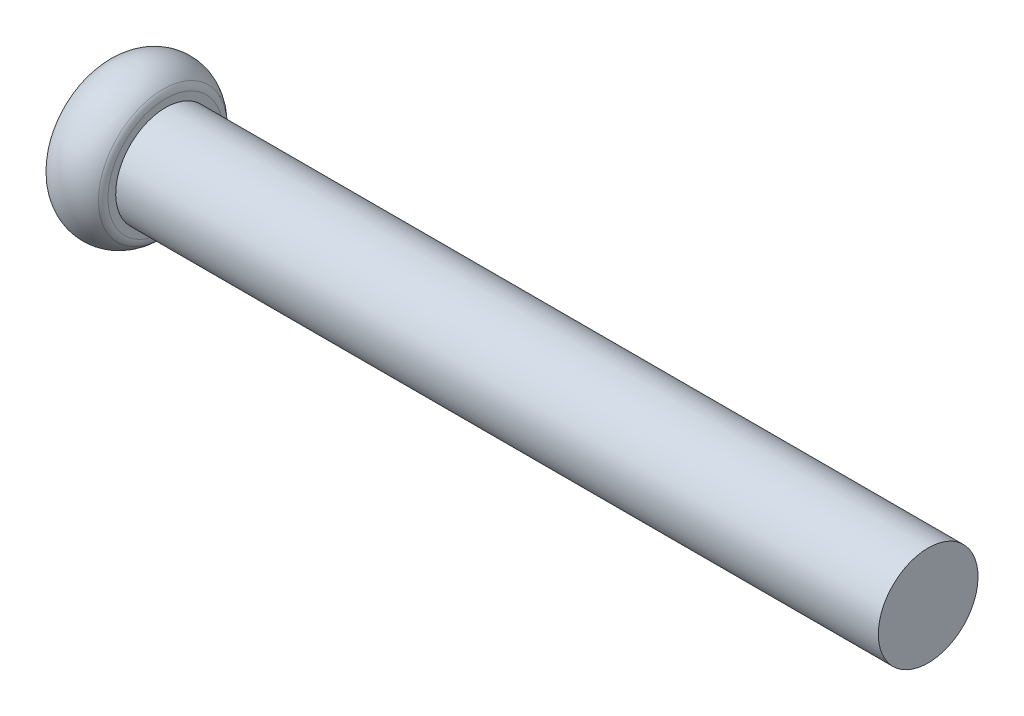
from build123d import *

# Parameters (mm, degrees)
CIRPATTERN1_COUNT = 2
CIRPATTERN1_ANGLE = 90
FILLET1_R         = 0.2


with BuildPart() as part:
    # Sketch1 → Revolve1 (revolve)
    with BuildSketch(Plane.XY):
        with BuildLine():
            Line((1.301883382, 1), (16.6, 1))
            Line((16.6, 1), (16.6, 0))
            Line((16.6, 0), (0, 0))
            Line((0, 0), (0, 0.793494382))
            ThreePointArc((0, 0.793494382), (0.028879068, 0.997099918), (0.113238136, 1.184643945))
            ThreePointArc((0.113238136, 1.184643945), (0.696476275, 1.519551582), (1.301883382, 1.22661458))
            Line((1.301883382, 1.22661458), (1.301883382, 1))
        make_face()
    revolve(axis=Axis((22.144755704, 0, 0), (-1, 0, 0)))

    # Sketch2 → Cut-Loft1 section 0
    with BuildSketch(Plane.ZY):
        with BuildLine():
            Line((-0.3, -1.175), (0.3, -1.175))
            Line((0.3, -1.175), (0.3, 1.175))
            Line((0.3, 1.175), (-0.3, 1.175))
            Line((-0.3, 1.175), (-0.3, -1.175))
        make_face()
    # Sketch3 → Cut-Loft1 section 1
    with BuildSketch(Plane(origin=(1.301883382, 0, 0), x_dir=(0, 0, -1), z_dir=(1, 0, 0))):
        with BuildLine():
            Line((0.35, -0.44201414), (-0.35, -0.44201414))
            Line((-0.35, -0.44201414), (-0.35, 0.44201414))
            Line((-0.35, 0.44201414), (0.35, 0.44201414))
            Line((0.35, 0.44201414), (0.35, -0.44201414))
        make_face()
    cut_loft1 = loft(mode=Mode.SUBTRACT)

    # CirPattern1: Cut-Loft1 ×2 about axis
    cirpattern1_axis = Axis((0, 0, 0), (-1, 0, 0))
    for i in range(1, CIRPATTERN1_COUNT):
        add(cut_loft1.rotate(cirpattern1_axis, i * CIRPATTERN1_ANGLE / (CIRPATTERN1_COUNT - 1)), mode=Mode.SUBTRACT)

    # Fillet1
    fillet1_edges = [part.edges().sort_by_distance(p)[0] for p in [
        (1.301883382, -1.22661458, 0),
    ]]
    fillet(fillet1_edges, radius=FILLET1_R)


solid = part.part
